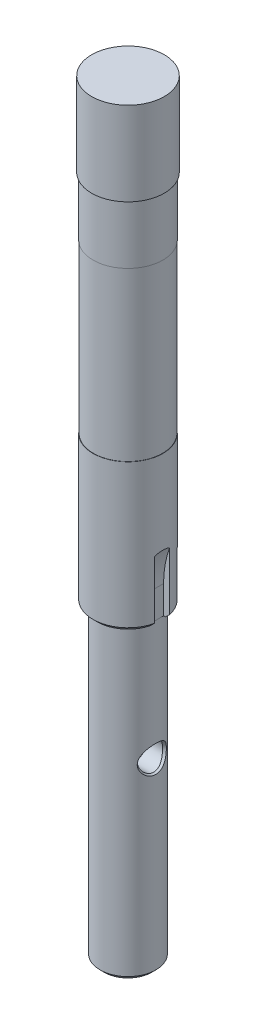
ISO-10303-21;
HEADER;
FILE_DESCRIPTION(('STEP AP214'),'2;1');
FILE_NAME('part.step','',(''),(''),'','','');
FILE_SCHEMA(('AUTOMOTIVE_DESIGN { 1 0 10303 214 1 1 1 1 }'));
ENDSEC;
DATA;
#1=APPLICATION_CONTEXT('core data for automotive mechanical design processes');
#2=APPLICATION_PROTOCOL_DEFINITION('international standard','automotive_design',2000,#1);
#3=PRODUCT_CONTEXT('',#1,'mechanical');
#4=PRODUCT('Part','Part','',(#3));
#5=PRODUCT_RELATED_PRODUCT_CATEGORY('part','',(#4));
#6=PRODUCT_DEFINITION_FORMATION('','',#4);
#7=PRODUCT_DEFINITION_CONTEXT('part definition',#1,'design');
#8=PRODUCT_DEFINITION('design','',#6,#7);
#9=PRODUCT_DEFINITION_SHAPE('','',#8);
#10=(LENGTH_UNIT() NAMED_UNIT(*) SI_UNIT(.MILLI.,.METRE.));
#11=(NAMED_UNIT(*) PLANE_ANGLE_UNIT() SI_UNIT($,.RADIAN.));
#12=(NAMED_UNIT(*) SI_UNIT($,.STERADIAN.) SOLID_ANGLE_UNIT());
#13=UNCERTAINTY_MEASURE_WITH_UNIT(LENGTH_MEASURE(1.E-05),#10,'distance_accuracy_value','');
#14=(GEOMETRIC_REPRESENTATION_CONTEXT(3) GLOBAL_UNCERTAINTY_ASSIGNED_CONTEXT((#13)) GLOBAL_UNIT_ASSIGNED_CONTEXT((#10,
#11,#12)) REPRESENTATION_CONTEXT('',''));
#15=CARTESIAN_POINT('',(0.,0.,0.));
#16=DIRECTION('',(0.,0.,1.));
#17=DIRECTION('',(1.,0.,0.));
#18=AXIS2_PLACEMENT_3D('',#15,#16,#17);
#19=CARTESIAN_POINT('',(0.,14.1587837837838,0.));
#20=DIRECTION('',(0.,1.,0.));
#21=DIRECTION('',(0.,0.,1.));
#22=AXIS2_PLACEMENT_3D('',#19,#20,#21);
#23=CYLINDRICAL_SURFACE('',#22,12.5);
#24=CARTESIAN_POINT('',(0.,-111.,0.));
#25=DIRECTION('',(0.,1.,0.));
#26=DIRECTION('',(0.,0.,1.));
#27=AXIS2_PLACEMENT_3D('',#24,#25,#26);
#28=CIRCLE('',#27,12.5);
#29=CARTESIAN_POINT('',(0.,-111.,12.5));
#30=VERTEX_POINT('',#29);
#31=EDGE_CURVE('E134',#30,#30,#28,.T.);
#32=ORIENTED_EDGE('',*,*,#31,.F.);
#33=EDGE_LOOP('',(#32));
#34=FACE_BOUND('',#33,.T.);
#35=CARTESIAN_POINT('',(12.1937483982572,-141.803694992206,2.75));
#36=CARTESIAN_POINT('',(12.2205381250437,-141.731634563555,2.63124158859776));
#37=CARTESIAN_POINT('',(12.2461131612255,-141.663569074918,2.50972630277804));
#38=CARTESIAN_POINT('',(12.2943703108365,-141.536195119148,2.26150738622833));
#39=CARTESIAN_POINT('',(12.3170498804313,-141.476894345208,2.13479932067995));
#40=CARTESIAN_POINT('',(12.3590829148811,-141.367740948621,1.87624425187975));
#41=CARTESIAN_POINT('',(12.3784235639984,-141.317924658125,1.74437973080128));
#42=CARTESIAN_POINT('',(12.4132049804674,-141.228818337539,1.47666887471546));
#43=CARTESIAN_POINT('',(12.428646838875,-141.189525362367,1.34082366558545));
#44=CARTESIAN_POINT('',(12.4553043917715,-141.121952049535,1.06520452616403));
#45=CARTESIAN_POINT('',(12.4664964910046,-141.093733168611,0.92541316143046));
#46=CARTESIAN_POINT('',(12.4842149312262,-141.049158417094,0.643662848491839));
#47=CARTESIAN_POINT('',(12.4907415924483,-141.032801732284,0.501704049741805));
#48=CARTESIAN_POINT('',(12.4989221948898,-141.012310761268,0.217117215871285));
#49=CARTESIAN_POINT('',(12.5005884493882,-141.008145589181,0.0744917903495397));
#50=CARTESIAN_POINT('',(12.4990414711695,-141.012018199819,-0.21052055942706));
#51=CARTESIAN_POINT('',(12.4958286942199,-141.02005484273,-0.352907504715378));
#52=CARTESIAN_POINT('',(12.4798084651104,-141.060211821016,-0.756978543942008));
#53=CARTESIAN_POINT('',(12.4611642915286,-141.107003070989,-1.01711693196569));
#54=CARTESIAN_POINT('',(12.40914479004,-141.23908181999,-1.52605566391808));
#55=CARTESIAN_POINT('',(12.375749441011,-141.324421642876,-1.77484008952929));
#56=CARTESIAN_POINT('',(12.315633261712,-141.480594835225,-2.14288587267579));
#57=CARTESIAN_POINT('',(12.2931391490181,-141.539430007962,-2.26812266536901));
#58=CARTESIAN_POINT('',(12.2454001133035,-141.665466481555,-2.51310011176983));
#59=CARTESIAN_POINT('',(12.2201670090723,-141.732632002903,-2.63286144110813));
#60=CARTESIAN_POINT('',(12.1937483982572,-141.803694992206,-2.74999999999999));
#61=B_SPLINE_CURVE_WITH_KNOTS('',3,(#35,#36,#37,#38,#39,#40,#41,#42,#43,#44,#45,#46,#47,#48,#49,
#50,#51,#52,#53,#54,#55,#56,#57,#58,#59,#60),.UNSPECIFIED.,.F.,.F.,(4,2,2,2,2,2,2,2,2,2,2,2,4),
(0.,0.424397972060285,0.849166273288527,1.27553036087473,1.70177500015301,2.13035275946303,
2.55890109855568,2.98636281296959,3.41378459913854,4.20477137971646,4.99683504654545,
5.41705501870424,5.83552885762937),.UNSPECIFIED.);
#62=CARTESIAN_POINT('',(12.1937483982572,-141.803694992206,2.75));
#63=VERTEX_POINT('',#62);
#64=CARTESIAN_POINT('',(12.1937483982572,-141.803694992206,-2.75));
#65=VERTEX_POINT('',#64);
#66=EDGE_CURVE('E12',#63,#65,#61,.T.);
#67=ORIENTED_EDGE('',*,*,#66,.T.);
#68=DIRECTION('',(0.,1.,0.));
#69=VECTOR('',#68,1.);
#70=CARTESIAN_POINT('',(12.1937483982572,14.1587837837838,-2.75));
#71=LINE('',#70,#69);
#72=CARTESIAN_POINT('',(12.1937483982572,-162.5,-2.75));
#73=VERTEX_POINT('',#72);
#74=EDGE_CURVE('E100',#65,#73,#71,.F.);
#75=ORIENTED_EDGE('',*,*,#74,.T.);
#76=CARTESIAN_POINT('',(0.,-162.5,0.));
#77=DIRECTION('',(0.,1.,0.));
#78=DIRECTION('',(0.,0.,1.));
#79=AXIS2_PLACEMENT_3D('',#76,#77,#78);
#80=CIRCLE('',#79,12.5);
#81=CARTESIAN_POINT('',(12.1937483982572,-162.5,2.75));
#82=VERTEX_POINT('',#81);
#83=EDGE_CURVE('E246',#73,#82,#80,.T.);
#84=ORIENTED_EDGE('',*,*,#83,.T.);
#85=DIRECTION('',(0.,1.,0.));
#86=VECTOR('',#85,1.);
#87=CARTESIAN_POINT('',(12.1937483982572,14.1587837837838,2.75));
#88=LINE('',#87,#86);
#89=EDGE_CURVE('E57',#63,#82,#88,.F.);
#90=ORIENTED_EDGE('',*,*,#89,.F.);
#91=EDGE_LOOP('',(#67,#75,#84,#90));
#92=FACE_BOUND('',#91,.T.);
#93=ADVANCED_FACE('F36',(#34,#92),#23,.T.);
#94=CARTESIAN_POINT('',(13.,0.,0.));
#95=DIRECTION('',(0.,-1.,0.));
#96=DIRECTION('',(0.,0.,-1.));
#97=AXIS2_PLACEMENT_3D('',#94,#95,#96);
#98=PLANE('',#97);
#99=CARTESIAN_POINT('',(0.,0.,0.));
#100=DIRECTION('',(0.,1.,0.));
#101=DIRECTION('',(0.,0.,1.));
#102=AXIS2_PLACEMENT_3D('',#99,#100,#101);
#103=CIRCLE('',#102,13.);
#104=CARTESIAN_POINT('',(0.,0.,13.));
#105=VERTEX_POINT('',#104);
#106=EDGE_CURVE('E152',#105,#105,#103,.T.);
#107=ORIENTED_EDGE('',*,*,#106,.T.);
#108=EDGE_LOOP('',(#107));
#109=FACE_BOUND('',#108,.T.);
#110=ADVANCED_FACE('F191',(#109),#98,.F.);
#111=CARTESIAN_POINT('',(0.,14.1587837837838,0.));
#112=DIRECTION('',(0.,1.,0.));
#113=DIRECTION('',(0.,0.,1.));
#114=AXIS2_PLACEMENT_3D('',#111,#112,#113);
#115=CYLINDRICAL_SURFACE('',#114,13.);
#116=ORIENTED_EDGE('',*,*,#106,.F.);
#117=EDGE_LOOP('',(#116));
#118=FACE_BOUND('',#117,.T.);
#119=CARTESIAN_POINT('',(0.,-30.,0.));
#120=DIRECTION('',(0.,1.,0.));
#121=DIRECTION('',(0.,0.,1.));
#122=AXIS2_PLACEMENT_3D('',#119,#120,#121);
#123=CIRCLE('',#122,13.);
#124=CARTESIAN_POINT('',(0.,-30.,13.));
#125=VERTEX_POINT('',#124);
#126=EDGE_CURVE('E149',#125,#125,#123,.T.);
#127=ORIENTED_EDGE('',*,*,#126,.T.);
#128=EDGE_LOOP('',(#127));
#129=FACE_BOUND('',#128,.T.);
#130=ADVANCED_FACE('F211',(#118,#129),#115,.T.);
#131=CARTESIAN_POINT('',(12.5,-30.,0.));
#132=DIRECTION('',(0.,1.,0.));
#133=DIRECTION('',(0.,0.,1.));
#134=AXIS2_PLACEMENT_3D('',#131,#132,#133);
#135=PLANE('',#134);
#136=ORIENTED_EDGE('',*,*,#126,.F.);
#137=EDGE_LOOP('',(#136));
#138=FACE_BOUND('',#137,.T.);
#139=CARTESIAN_POINT('',(0.,-30.,0.));
#140=DIRECTION('',(0.,1.,0.));
#141=DIRECTION('',(0.,0.,1.));
#142=AXIS2_PLACEMENT_3D('',#139,#140,#141);
#143=CIRCLE('',#142,12.5);
#144=CARTESIAN_POINT('',(0.,-30.,12.5));
#145=VERTEX_POINT('',#144);
#146=EDGE_CURVE('E146',#145,#145,#143,.T.);
#147=ORIENTED_EDGE('',*,*,#146,.T.);
#148=EDGE_LOOP('',(#147));
#149=FACE_BOUND('',#148,.T.);
#150=ADVANCED_FACE('F207',(#138,#149),#135,.F.);
#151=CARTESIAN_POINT('',(0.,14.1587837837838,0.));
#152=DIRECTION('',(0.,1.,0.));
#153=DIRECTION('',(0.,0.,1.));
#154=AXIS2_PLACEMENT_3D('',#151,#152,#153);
#155=CYLINDRICAL_SURFACE('',#154,12.5);
#156=ORIENTED_EDGE('',*,*,#146,.F.);
#157=EDGE_LOOP('',(#156));
#158=FACE_BOUND('',#157,.T.);
#159=CARTESIAN_POINT('',(0.,-51.,0.));
#160=DIRECTION('',(0.,1.,0.));
#161=DIRECTION('',(0.,0.,1.));
#162=AXIS2_PLACEMENT_3D('',#159,#160,#161);
#163=CIRCLE('',#162,12.5);
#164=CARTESIAN_POINT('',(0.,-51.,12.5));
#165=VERTEX_POINT('',#164);
#166=EDGE_CURVE('E143',#165,#165,#163,.T.);
#167=ORIENTED_EDGE('',*,*,#166,.T.);
#168=EDGE_LOOP('',(#167));
#169=FACE_BOUND('',#168,.T.);
#170=ADVANCED_FACE('F203',(#158,#169),#155,.T.);
#171=CARTESIAN_POINT('',(12.4,-51.,0.));
#172=DIRECTION('',(0.,1.,0.));
#173=DIRECTION('',(0.,0.,1.));
#174=AXIS2_PLACEMENT_3D('',#171,#172,#173);
#175=PLANE('',#174);
#176=ORIENTED_EDGE('',*,*,#166,.F.);
#177=EDGE_LOOP('',(#176));
#178=FACE_BOUND('',#177,.T.);
#179=CARTESIAN_POINT('',(0.,-51.,0.));
#180=DIRECTION('',(0.,1.,0.));
#181=DIRECTION('',(0.,0.,1.));
#182=AXIS2_PLACEMENT_3D('',#179,#180,#181);
#183=CIRCLE('',#182,12.4);
#184=CARTESIAN_POINT('',(0.,-51.,12.4));
#185=VERTEX_POINT('',#184);
#186=EDGE_CURVE('E140',#185,#185,#183,.T.);
#187=ORIENTED_EDGE('',*,*,#186,.T.);
#188=EDGE_LOOP('',(#187));
#189=FACE_BOUND('',#188,.T.);
#190=ADVANCED_FACE('F199',(#178,#189),#175,.F.);
#191=CARTESIAN_POINT('',(0.,14.1587837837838,0.));
#192=DIRECTION('',(0.,1.,0.));
#193=DIRECTION('',(0.,0.,1.));
#194=AXIS2_PLACEMENT_3D('',#191,#192,#193);
#195=CYLINDRICAL_SURFACE('',#194,12.4);
#196=ORIENTED_EDGE('',*,*,#186,.F.);
#197=EDGE_LOOP('',(#196));
#198=FACE_BOUND('',#197,.T.);
#199=CARTESIAN_POINT('',(0.,-111.,0.));
#200=DIRECTION('',(0.,1.,0.));
#201=DIRECTION('',(0.,0.,1.));
#202=AXIS2_PLACEMENT_3D('',#199,#200,#201);
#203=CIRCLE('',#202,12.4);
#204=CARTESIAN_POINT('',(0.,-111.,12.4));
#205=VERTEX_POINT('',#204);
#206=EDGE_CURVE('E137',#205,#205,#203,.T.);
#207=ORIENTED_EDGE('',*,*,#206,.T.);
#208=EDGE_LOOP('',(#207));
#209=FACE_BOUND('',#208,.T.);
#210=ADVANCED_FACE('F195',(#198,#209),#195,.T.);
#211=CARTESIAN_POINT('',(12.5,-111.,0.));
#212=DIRECTION('',(0.,-1.,0.));
#213=DIRECTION('',(0.,0.,-1.));
#214=AXIS2_PLACEMENT_3D('',#211,#212,#213);
#215=PLANE('',#214);
#216=ORIENTED_EDGE('',*,*,#206,.F.);
#217=EDGE_LOOP('',(#216));
#218=FACE_BOUND('',#217,.T.);
#219=ORIENTED_EDGE('',*,*,#31,.T.);
#220=EDGE_LOOP('',(#219));
#221=FACE_BOUND('',#220,.T.);
#222=ADVANCED_FACE('F186',(#218,#221),#215,.F.);
#223=CARTESIAN_POINT('',(10.,-164.,0.));
#224=DIRECTION('',(0.,1.,0.));
#225=DIRECTION('',(0.,0.,1.));
#226=AXIS2_PLACEMENT_3D('',#223,#224,#225);
#227=PLANE('',#226);
#228=CARTESIAN_POINT('',(0.,-164.,0.));
#229=DIRECTION('',(0.,1.,0.));
#230=DIRECTION('',(0.,0.,1.));
#231=AXIS2_PLACEMENT_3D('',#228,#229,#230);
#232=CIRCLE('',#231,11.);
#233=CARTESIAN_POINT('',(10.6507042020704,-164.,2.75));
#234=VERTEX_POINT('',#233);
#235=CARTESIAN_POINT('',(10.6507042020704,-164.,-2.75));
#236=VERTEX_POINT('',#235);
#237=EDGE_CURVE('E254',#234,#236,#232,.F.);
#238=ORIENTED_EDGE('',*,*,#237,.T.);
#239=DIRECTION('',(1.,0.,0.));
#240=VECTOR('',#239,1.);
#241=CARTESIAN_POINT('',(12.5,-164.,-2.75));
#242=LINE('',#241,#240);
#243=CARTESIAN_POINT('',(10.,-164.,-2.75));
#244=VERTEX_POINT('',#243);
#245=EDGE_CURVE('E102',#244,#236,#242,.T.);
#246=ORIENTED_EDGE('',*,*,#245,.F.);
#247=DIRECTION('',(0.,0.,1.));
#248=VECTOR('',#247,1.);
#249=CARTESIAN_POINT('',(10.,-164.,-2.75));
#250=LINE('',#249,#248);
#251=CARTESIAN_POINT('',(10.,-164.,0.));
#252=VERTEX_POINT('',#251);
#253=EDGE_CURVE('E115',#244,#252,#250,.T.);
#254=ORIENTED_EDGE('',*,*,#253,.T.);
#255=CARTESIAN_POINT('',(0.,-164.,0.));
#256=DIRECTION('',(0.,1.,0.));
#257=DIRECTION('',(0.,0.,1.));
#258=AXIS2_PLACEMENT_3D('',#255,#256,#257);
#259=CIRCLE('',#258,10.);
#260=EDGE_CURVE('E131',#252,#252,#259,.T.);
#261=ORIENTED_EDGE('',*,*,#260,.T.);
#262=CARTESIAN_POINT('',(10.,-164.,2.75));
#263=VERTEX_POINT('',#262);
#264=EDGE_CURVE('E111',#252,#263,#250,.T.);
#265=ORIENTED_EDGE('',*,*,#264,.T.);
#266=DIRECTION('',(1.,0.,0.));
#267=VECTOR('',#266,1.);
#268=CARTESIAN_POINT('',(12.5,-164.,2.75));
#269=LINE('',#268,#267);
#270=EDGE_CURVE('E119',#263,#234,#269,.T.);
#271=ORIENTED_EDGE('',*,*,#270,.T.);
#272=EDGE_LOOP('',(#238,#246,#254,#261,#265,#271));
#273=FACE_BOUND('',#272,.T.);
#274=ADVANCED_FACE('F183',(#273),#227,.F.);
#275=CARTESIAN_POINT('',(0.,14.1587837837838,0.));
#276=DIRECTION('',(0.,1.,0.));
#277=DIRECTION('',(0.,0.,1.));
#278=AXIS2_PLACEMENT_3D('',#275,#276,#277);
#279=CYLINDRICAL_SURFACE('',#278,10.);
#280=CARTESIAN_POINT('',(8.53041436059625,-207.,-5.21843183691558));
#281=CARTESIAN_POINT('',(8.53043923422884,-206.959501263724,-5.21838043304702));
#282=CARTESIAN_POINT('',(8.53083475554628,-206.919004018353,-5.2177644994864));
#283=CARTESIAN_POINT('',(8.53234603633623,-206.838147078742,-5.21541331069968));
#284=CARTESIAN_POINT('',(8.53346016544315,-206.797787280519,-5.21368058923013));
#285=CARTESIAN_POINT('',(8.53638544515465,-206.717223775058,-5.20910908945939));
#286=CARTESIAN_POINT('',(8.5381954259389,-206.677019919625,-5.20627216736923));
#287=CARTESIAN_POINT('',(8.54248871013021,-206.596786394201,-5.19950622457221));
#288=CARTESIAN_POINT('',(8.54497124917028,-206.556756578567,-5.19557844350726));
#289=CARTESIAN_POINT('',(8.55058615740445,-206.476889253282,-5.18664446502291));
#290=CARTESIAN_POINT('',(8.55371811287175,-206.437051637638,-5.18163895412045));
#291=CARTESIAN_POINT('',(8.56060835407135,-206.357586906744,-5.17056322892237));
#292=CARTESIAN_POINT('',(8.56436652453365,-206.317959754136,-5.16449321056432));
#293=CARTESIAN_POINT('',(8.5724858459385,-206.23893360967,-5.15130195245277));
#294=CARTESIAN_POINT('',(8.57684713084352,-206.199534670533,-5.14418047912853));
#295=CARTESIAN_POINT('',(8.58614904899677,-206.120984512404,-5.12890030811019));
#296=CARTESIAN_POINT('',(8.59109001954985,-206.081833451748,-5.12074100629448));
#297=CARTESIAN_POINT('',(8.60675583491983,-205.96471492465,-5.09471263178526));
#298=CARTESIAN_POINT('',(8.61831215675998,-205.887192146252,-5.07531151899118));
#299=CARTESIAN_POINT('',(8.6434603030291,-205.733356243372,-5.03252591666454));
#300=CARTESIAN_POINT('',(8.65705779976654,-205.657047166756,-5.00913030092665));
#301=CARTESIAN_POINT('',(8.68610268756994,-205.505774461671,-4.9584627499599));
#302=CARTESIAN_POINT('',(8.70155650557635,-205.430816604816,-4.93117728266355));
#303=CARTESIAN_POINT('',(8.73412831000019,-205.282391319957,-4.87283734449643));
#304=CARTESIAN_POINT('',(8.75125276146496,-205.208931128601,-4.84176810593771));
#305=CARTESIAN_POINT('',(8.78698101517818,-205.063644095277,-4.77596638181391));
#306=CARTESIAN_POINT('',(8.80559082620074,-204.991825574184,-4.74121881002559));
#307=CARTESIAN_POINT('',(8.84410538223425,-204.849965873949,-4.66816543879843));
#308=CARTESIAN_POINT('',(8.8640153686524,-204.779933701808,-4.62984493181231));
#309=CARTESIAN_POINT('',(8.90494599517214,-204.641790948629,-4.54974996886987));
#310=CARTESIAN_POINT('',(8.92597094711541,-204.57368966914,-4.50796168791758));
#311=CARTESIAN_POINT('',(8.96894787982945,-204.439553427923,-4.42103519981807));
#312=CARTESIAN_POINT('',(8.99090319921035,-204.373527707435,-4.37588439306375));
#313=CARTESIAN_POINT('',(9.03555523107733,-204.243687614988,-4.28233578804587));
#314=CARTESIAN_POINT('',(9.05825434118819,-204.179882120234,-4.23392681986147));
#315=CARTESIAN_POINT('',(9.10421586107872,-204.054628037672,-4.1339675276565));
#316=CARTESIAN_POINT('',(9.12747985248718,-203.993187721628,-4.08240756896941));
#317=CARTESIAN_POINT('',(9.17436440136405,-203.8728090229,-3.97624100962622));
#318=CARTESIAN_POINT('',(9.19798577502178,-203.813878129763,-3.92162628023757));
#319=CARTESIAN_POINT('',(9.24548512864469,-203.69866641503,-3.80948551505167));
#320=CARTESIAN_POINT('',(9.26936358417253,-203.642392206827,-3.75195288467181));
#321=CARTESIAN_POINT('',(9.31691145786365,-203.532550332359,-3.63387272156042));
#322=CARTESIAN_POINT('',(9.34057987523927,-203.478992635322,-3.57331550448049));
#323=CARTESIAN_POINT('',(9.38729489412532,-203.374590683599,-3.44916549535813));
#324=CARTESIAN_POINT('',(9.4103381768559,-203.323759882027,-3.38556014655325));
#325=CARTESIAN_POINT('',(9.45575441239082,-203.224915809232,-3.25551984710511));
#326=CARTESIAN_POINT('',(9.47812420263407,-203.176915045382,-3.18907429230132));
#327=CARTESIAN_POINT('',(9.52203685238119,-203.083833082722,-3.05351930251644));
#328=CARTESIAN_POINT('',(9.54357637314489,-203.038763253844,-2.98440098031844));
#329=CARTESIAN_POINT('',(9.58570085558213,-202.951646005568,-2.84367710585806));
#330=CARTESIAN_POINT('',(9.60628254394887,-202.909608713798,-2.77206430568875));
#331=CARTESIAN_POINT('',(9.64635575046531,-202.828659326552,-2.62652532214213));
#332=CARTESIAN_POINT('',(9.6658441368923,-202.7897560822,-2.55259335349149));
#333=CARTESIAN_POINT('',(9.70359713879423,-202.715177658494,-2.4025908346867));
#334=CARTESIAN_POINT('',(9.72185884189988,-202.679510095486,-2.32651576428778));
#335=CARTESIAN_POINT('',(9.75702423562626,-202.611505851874,-2.17240182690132));
#336=CARTESIAN_POINT('',(9.7739252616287,-202.579175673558,-2.09435948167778));
#337=CARTESIAN_POINT('',(9.80623518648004,-202.51794889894,-1.93648605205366));
#338=CARTESIAN_POINT('',(9.82164164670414,-202.489057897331,-1.85665229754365));
#339=CARTESIAN_POINT('',(9.85082830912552,-202.434811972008,-1.6953713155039));
#340=CARTESIAN_POINT('',(9.86460621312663,-202.409462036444,-1.61392199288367));
#341=CARTESIAN_POINT('',(9.89040174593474,-202.362400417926,-1.44958536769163));
#342=CARTESIAN_POINT('',(9.90241705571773,-202.340693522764,-1.3666963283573));
#343=CARTESIAN_POINT('',(9.92455351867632,-202.30101981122,-1.19965596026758));
#344=CARTESIAN_POINT('',(9.934672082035,-202.283058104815,-1.11550307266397));
#345=CARTESIAN_POINT('',(9.95288156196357,-202.250975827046,-0.946110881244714));
#346=CARTESIAN_POINT('',(9.96096926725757,-202.236861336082,-0.860870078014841));
#347=CARTESIAN_POINT('',(9.97498343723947,-202.212574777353,-0.689477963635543));
#348=CARTESIAN_POINT('',(9.98090560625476,-202.202410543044,-0.603325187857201));
#349=CARTESIAN_POINT('',(9.99045735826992,-202.186121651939,-0.430285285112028));
#350=CARTESIAN_POINT('',(9.99408098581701,-202.180007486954,-0.343396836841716));
#351=CARTESIAN_POINT('',(9.99889829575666,-202.171927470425,-0.169060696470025));
#352=CARTESIAN_POINT('',(10.0000836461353,-202.169975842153,-0.0816121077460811));
#353=CARTESIAN_POINT('',(9.99991297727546,-202.170280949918,0.0932501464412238));
#354=CARTESIAN_POINT('',(9.99855766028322,-202.172536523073,0.180663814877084));
#355=CARTESIAN_POINT('',(9.99343669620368,-202.181156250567,0.354869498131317));
#356=CARTESIAN_POINT('',(9.98968057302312,-202.18750417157,0.441662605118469));
#357=CARTESIAN_POINT('',(9.97988732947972,-202.204217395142,0.614459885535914));
#358=CARTESIAN_POINT('',(9.97385726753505,-202.214570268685,0.700465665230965));
#359=CARTESIAN_POINT('',(9.95965132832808,-202.23919074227,0.87152100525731));
#360=CARTESIAN_POINT('',(9.95148067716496,-202.253448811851,0.956572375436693));
#361=CARTESIAN_POINT('',(9.93312634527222,-202.285781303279,1.1255519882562));
#362=CARTESIAN_POINT('',(9.92294661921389,-202.30384823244,1.20948209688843));
#363=CARTESIAN_POINT('',(9.9007068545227,-202.343700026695,1.376052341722));
#364=CARTESIAN_POINT('',(9.8886499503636,-202.365478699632,1.45869438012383));
#365=CARTESIAN_POINT('',(9.86278799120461,-202.412656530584,1.62252162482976));
#366=CARTESIAN_POINT('',(9.84898560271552,-202.438050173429,1.70370884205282));
#367=CARTESIAN_POINT('',(9.81976453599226,-202.492361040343,1.86445947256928));
#368=CARTESIAN_POINT('',(9.80434831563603,-202.521272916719,1.94402514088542));
#369=CARTESIAN_POINT('',(9.77203120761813,-202.582523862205,2.10136554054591));
#370=CARTESIAN_POINT('',(9.75513274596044,-202.614857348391,2.17914294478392));
#371=CARTESIAN_POINT('',(9.71998258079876,-202.682855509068,2.33273947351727));
#372=CARTESIAN_POINT('',(9.70173337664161,-202.718514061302,2.4085618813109));
#373=CARTESIAN_POINT('',(9.66401320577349,-202.793066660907,2.55808090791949));
#374=CARTESIAN_POINT('',(9.64454485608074,-202.831953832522,2.63178161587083));
#375=CARTESIAN_POINT('',(9.60451729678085,-202.91286813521,2.77688935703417));
#376=CARTESIAN_POINT('',(9.58396081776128,-202.954887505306,2.84830147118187));
#377=CARTESIAN_POINT('',(9.54188993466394,-203.041970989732,2.98866456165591));
#378=CARTESIAN_POINT('',(9.52037832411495,-203.087026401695,3.05762177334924));
#379=CARTESIAN_POINT('',(9.47652265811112,-203.180086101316,3.19290512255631));
#380=CARTESIAN_POINT('',(9.45418140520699,-203.228080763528,3.25923878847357));
#381=CARTESIAN_POINT('',(9.40881989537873,-203.32692571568,3.38911352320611));
#382=CARTESIAN_POINT('',(9.38580225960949,-203.377765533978,3.45266347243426));
#383=CARTESIAN_POINT('',(9.3391379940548,-203.482197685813,3.57677741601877));
#384=CARTESIAN_POINT('',(9.31549407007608,-203.535778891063,3.6373517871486));
#385=CARTESIAN_POINT('',(9.26798571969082,-203.645686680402,3.75550331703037));
#386=CARTESIAN_POINT('',(9.24412214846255,-203.702004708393,3.81308878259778));
#387=CARTESIAN_POINT('',(9.19663863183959,-203.817327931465,3.92532258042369));
#388=CARTESIAN_POINT('',(9.17301826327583,-203.876326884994,3.97997714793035));
#389=CARTESIAN_POINT('',(9.1261285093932,-203.996859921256,4.08621592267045));
#390=CARTESIAN_POINT('',(9.10285835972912,-204.058386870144,4.13780788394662));
#391=CARTESIAN_POINT('',(9.0568790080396,-204.183833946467,4.23781995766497));
#392=CARTESIAN_POINT('',(9.03416830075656,-204.2477461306,4.28624933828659));
#393=CARTESIAN_POINT('',(8.98949059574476,-204.377818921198,4.37982617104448));
#394=CARTESIAN_POINT('',(8.96752129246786,-204.443970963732,4.42498441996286));
#395=CARTESIAN_POINT('',(8.92451659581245,-204.578379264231,4.51191119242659));
#396=CARTESIAN_POINT('',(8.90347797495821,-204.646626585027,4.55369192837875));
#397=CARTESIAN_POINT('',(8.86252298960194,-204.785080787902,4.63375537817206));
#398=CARTESIAN_POINT('',(8.84260244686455,-204.855278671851,4.67205150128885));
#399=CARTESIAN_POINT('',(8.80407250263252,-204.997489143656,4.74503782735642));
#400=CARTESIAN_POINT('',(8.78545802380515,-205.069493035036,4.77974227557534));
#401=CARTESIAN_POINT('',(8.74972890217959,-205.215170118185,4.84543765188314));
#402=CARTESIAN_POINT('',(8.73260845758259,-205.288835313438,4.87644313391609));
#403=CARTESIAN_POINT('',(8.70005586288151,-205.437689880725,4.93463365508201));
#404=CARTESIAN_POINT('',(8.68461751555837,-205.512872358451,4.96183283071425));
#405=CARTESIAN_POINT('',(8.65561747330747,-205.66461351,5.01230412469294));
#406=CARTESIAN_POINT('',(8.64204970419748,-205.7411667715,5.0355890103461));
#407=CARTESIAN_POINT('',(8.61697760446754,-205.895510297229,5.07812773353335));
#408=CARTESIAN_POINT('',(8.60546806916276,-205.973296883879,5.09739175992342));
#409=CARTESIAN_POINT('',(8.58988806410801,-206.090816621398,5.12319215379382));
#410=CARTESIAN_POINT('',(8.5849778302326,-206.130106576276,5.13127251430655));
#411=CARTESIAN_POINT('',(8.57574258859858,-206.208939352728,5.1463876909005));
#412=CARTESIAN_POINT('',(8.5714173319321,-206.248482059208,5.15342295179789));
#413=CARTESIAN_POINT('',(8.56337560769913,-206.327800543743,5.1664344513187));
#414=CARTESIAN_POINT('',(8.55965910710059,-206.367576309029,5.17241074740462));
#415=CARTESIAN_POINT('',(8.55285808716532,-206.447343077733,5.18329146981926));
#416=CARTESIAN_POINT('',(8.54977379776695,-206.487334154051,5.18819550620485));
#417=CARTESIAN_POINT('',(8.54426040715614,-206.567513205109,5.19691879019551));
#418=CARTESIAN_POINT('',(8.54183184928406,-206.60770131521,5.20073713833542));
#419=CARTESIAN_POINT('',(8.53765315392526,-206.688256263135,5.20727614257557));
#420=CARTESIAN_POINT('',(8.53590392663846,-206.728623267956,5.20999532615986));
#421=CARTESIAN_POINT('',(8.53310670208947,-206.809517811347,5.21432347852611));
#422=CARTESIAN_POINT('',(8.53206003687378,-206.850045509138,5.21593033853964));
#423=CARTESIAN_POINT('',(8.5306920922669,-206.931243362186,5.21802015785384));
#424=CARTESIAN_POINT('',(8.53037262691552,-206.971913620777,5.21850030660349));
#425=CARTESIAN_POINT('',(8.53047774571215,-207.053240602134,5.2183279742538));
#426=CARTESIAN_POINT('',(8.53090214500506,-207.093897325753,5.21767577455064));
#427=CARTESIAN_POINT('',(8.53247182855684,-207.175042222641,5.2152491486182));
#428=CARTESIAN_POINT('',(8.53361496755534,-207.215530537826,5.21347806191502));
#429=CARTESIAN_POINT('',(8.53659941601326,-207.296321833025,5.20882680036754));
#430=CARTESIAN_POINT('',(8.53843907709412,-207.336625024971,5.20594924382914));
#431=CARTESIAN_POINT('',(8.54279250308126,-207.417029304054,5.19909935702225));
#432=CARTESIAN_POINT('',(8.54530506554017,-207.457130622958,5.19512897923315));
#433=CARTESIAN_POINT('',(8.55098066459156,-207.537114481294,5.18610736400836));
#434=CARTESIAN_POINT('',(8.55414288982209,-207.576997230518,5.18105747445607));
#435=CARTESIAN_POINT('',(8.56109411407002,-207.656527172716,5.16989081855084));
#436=CARTESIAN_POINT('',(8.56488264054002,-207.696174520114,5.16377485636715));
#437=CARTESIAN_POINT('',(8.5730629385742,-207.775217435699,5.15048979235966));
#438=CARTESIAN_POINT('',(8.57745452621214,-207.814613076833,5.14332101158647));
#439=CARTESIAN_POINT('',(8.58681711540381,-207.893134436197,5.12794459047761));
#440=CARTESIAN_POINT('',(8.59178817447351,-207.932260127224,5.11973684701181));
#441=CARTESIAN_POINT('',(8.60754090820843,-208.049247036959,5.09356636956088));
#442=CARTESIAN_POINT('',(8.61915598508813,-208.126659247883,5.07406631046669));
#443=CARTESIAN_POINT('',(8.64442070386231,-208.280201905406,5.0310775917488));
#444=CARTESIAN_POINT('',(8.65807458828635,-208.356329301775,5.00758060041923));
#445=CARTESIAN_POINT('',(8.68722964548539,-208.507178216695,4.9567075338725));
#446=CARTESIAN_POINT('',(8.70273625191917,-208.581894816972,4.92932000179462));
#447=CARTESIAN_POINT('',(8.73540945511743,-208.729788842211,4.87077553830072));
#448=CARTESIAN_POINT('',(8.75258187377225,-208.802959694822,4.83960528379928));
#449=CARTESIAN_POINT('',(8.78840039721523,-208.947631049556,4.77360340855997));
#450=CARTESIAN_POINT('',(8.80705213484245,-209.019123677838,4.73875760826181));
#451=CARTESIAN_POINT('',(8.84564347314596,-209.160306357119,4.66551184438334));
#452=CARTESIAN_POINT('',(8.86558813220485,-209.229987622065,4.62709763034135));
#453=CARTESIAN_POINT('',(8.906579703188,-209.367415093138,4.54682141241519));
#454=CARTESIAN_POINT('',(8.92763087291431,-209.43515199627,4.50494567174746));
#455=CARTESIAN_POINT('',(8.97065055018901,-209.568557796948,4.41785244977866));
#456=CARTESIAN_POINT('',(8.99262241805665,-209.634217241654,4.37262215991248));
#457=CARTESIAN_POINT('',(9.03729669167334,-209.76333479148,4.27892469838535));
#458=CARTESIAN_POINT('',(9.06000154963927,-209.826783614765,4.23044591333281));
#459=CARTESIAN_POINT('',(9.10596229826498,-209.951346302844,4.13035909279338));
#460=CARTESIAN_POINT('',(9.12921982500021,-210.012451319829,4.07874080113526));
#461=CARTESIAN_POINT('',(9.1760788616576,-210.132192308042,3.97247113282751));
#462=CARTESIAN_POINT('',(9.19968121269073,-210.190820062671,3.91781087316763));
#463=CARTESIAN_POINT('',(9.24712569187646,-210.305472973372,3.80559587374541));
#464=CARTESIAN_POINT('',(9.27096829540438,-210.36149067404,3.74803371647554));
#465=CARTESIAN_POINT('',(9.31843703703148,-210.470865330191,3.62990977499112));
#466=CARTESIAN_POINT('',(9.34206202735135,-210.524211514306,3.56933754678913));
#467=CARTESIAN_POINT('',(9.38869386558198,-210.62822090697,3.44516724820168));
#468=CARTESIAN_POINT('',(9.41169720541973,-210.678870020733,3.38155605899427));
#469=CARTESIAN_POINT('',(9.45703418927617,-210.777381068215,3.25151440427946));
#470=CARTESIAN_POINT('',(9.4793645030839,-210.82522998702,3.18507292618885));
#471=CARTESIAN_POINT('',(9.5231996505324,-210.918034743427,3.04953520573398));
#472=CARTESIAN_POINT('',(9.54470099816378,-210.962978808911,2.9804297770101));
#473=CARTESIAN_POINT('',(9.58675036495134,-211.049868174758,2.83974011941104));
#474=CARTESIAN_POINT('',(9.60729498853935,-211.091803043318,2.76814843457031));
#475=CARTESIAN_POINT('',(9.64729534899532,-211.172568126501,2.62265931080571));
#476=CARTESIAN_POINT('',(9.66674785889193,-211.21138927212,2.54875595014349));
#477=CARTESIAN_POINT('',(9.70443036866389,-211.285821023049,2.39881752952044));
#478=CARTESIAN_POINT('',(9.72265738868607,-211.321423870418,2.32277786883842));
#479=CARTESIAN_POINT('',(9.7577546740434,-211.389313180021,2.16874089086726));
#480=CARTESIAN_POINT('',(9.77462223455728,-211.421593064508,2.09074005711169));
#481=CARTESIAN_POINT('',(9.80686647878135,-211.482730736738,1.9329550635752));
#482=CARTESIAN_POINT('',(9.82224070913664,-211.511582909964,1.85316822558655));
#483=CARTESIAN_POINT('',(9.85136415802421,-211.565759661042,1.69198577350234));
#484=CARTESIAN_POINT('',(9.86511108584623,-211.591079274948,1.61058807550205));
#485=CARTESIAN_POINT('',(9.89084591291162,-211.638085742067,1.44635869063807));
#486=CARTESIAN_POINT('',(9.90283151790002,-211.659767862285,1.36352528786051));
#487=CARTESIAN_POINT('',(9.92490981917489,-211.699394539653,1.1965994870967));
#488=CARTESIAN_POINT('',(9.93499996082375,-211.717334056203,1.11250555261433));
#489=CARTESIAN_POINT('',(9.95315387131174,-211.749371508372,0.943233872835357));
#490=CARTESIAN_POINT('',(9.96121446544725,-211.763463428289,0.85805464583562));
#491=CARTESIAN_POINT('',(9.97517565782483,-211.787701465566,0.686787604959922));
#492=CARTESIAN_POINT('',(9.98107198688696,-211.797839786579,0.600698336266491));
#493=CARTESIAN_POINT('',(9.99057352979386,-211.814070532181,0.427786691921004));
#494=CARTESIAN_POINT('',(9.99417279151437,-211.820152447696,0.340962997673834));
#495=CARTESIAN_POINT('',(9.99894216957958,-211.828158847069,0.166756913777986));
#496=CARTESIAN_POINT('',(10.0001039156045,-211.830069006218,0.0793736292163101));
#497=CARTESIAN_POINT('',(9.99988970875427,-211.829668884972,-0.0953556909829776));
#498=CARTESIAN_POINT('',(9.99851443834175,-211.827359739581,-0.182701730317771));
#499=CARTESIAN_POINT('',(9.99335974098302,-211.818624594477,-0.356768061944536));
#500=CARTESIAN_POINT('',(9.98958983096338,-211.812214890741,-0.443489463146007));
#501=CARTESIAN_POINT('',(9.97977423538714,-211.795374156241,-0.616139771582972));
#502=CARTESIAN_POINT('',(9.97373558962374,-211.784955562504,-0.702070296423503));
#503=CARTESIAN_POINT('',(9.9595176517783,-211.760203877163,-0.872972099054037));
#504=CARTESIAN_POINT('',(9.95134356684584,-211.745880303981,-0.957945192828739));
#505=CARTESIAN_POINT('',(9.93298722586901,-211.713421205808,-1.12676575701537));
#506=CARTESIAN_POINT('',(9.92280891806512,-211.69529317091,-1.21061509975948));
#507=CARTESIAN_POINT('',(9.90057659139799,-211.655327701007,-1.37702184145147));
#508=CARTESIAN_POINT('',(9.88852572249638,-211.633496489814,-1.45958115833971));
#509=CARTESIAN_POINT('',(9.86268015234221,-211.586226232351,-1.62324150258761));
#510=CARTESIAN_POINT('',(9.84888816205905,-211.560792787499,-1.70434457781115));
#511=CARTESIAN_POINT('',(9.81969192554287,-211.506419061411,-1.86492596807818));
#512=CARTESIAN_POINT('',(9.8042902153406,-211.477484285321,-1.94440660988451));
#513=CARTESIAN_POINT('',(9.7720058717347,-211.41620836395,-2.10157648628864));
#514=CARTESIAN_POINT('',(9.75512577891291,-211.383873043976,-2.17926851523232));
#515=CARTESIAN_POINT('',(9.72001580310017,-211.315896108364,-2.33269429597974));
#516=CARTESIAN_POINT('',(9.70178857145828,-211.280260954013,-2.40843151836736));
#517=CARTESIAN_POINT('',(9.66411550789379,-211.205784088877,-2.55778062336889));
#518=CARTESIAN_POINT('',(9.64467248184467,-211.166949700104,-2.6313968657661));
#519=CARTESIAN_POINT('',(9.60469843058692,-211.086173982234,-2.77633658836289));
#520=CARTESIAN_POINT('',(9.58417035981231,-211.044240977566,-2.84766552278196));
#521=CARTESIAN_POINT('',(9.5421589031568,-210.957367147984,-2.98786347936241));
#522=CARTESIAN_POINT('',(9.5206785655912,-210.912435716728,-3.05673923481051));
#523=CARTESIAN_POINT('',(9.47688763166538,-210.819665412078,-3.19186167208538));
#524=CARTESIAN_POINT('',(9.45458012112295,-210.77183699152,-3.25811652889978));
#525=CARTESIAN_POINT('',(9.40928850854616,-210.673368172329,-3.38783459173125));
#526=CARTESIAN_POINT('',(9.38630732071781,-210.622739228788,-3.45130750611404));
#527=CARTESIAN_POINT('',(9.33971625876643,-210.518783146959,-3.57527395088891));
#528=CARTESIAN_POINT('',(9.31610943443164,-210.465468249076,-3.63577888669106));
#529=CARTESIAN_POINT('',(9.2686719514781,-210.356103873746,-3.75380360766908));
#530=CARTESIAN_POINT('',(9.24484218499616,-210.300063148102,-3.81133186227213));
#531=CARTESIAN_POINT('',(9.1974201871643,-210.185265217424,-3.92346798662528));
#532=CARTESIAN_POINT('',(9.17382758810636,-210.126513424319,-3.97808124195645));
#533=CARTESIAN_POINT('',(9.12698563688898,-210.006455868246,-4.08425787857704));
#534=CARTESIAN_POINT('',(9.10373559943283,-209.945156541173,-4.13582823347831));
#535=CARTESIAN_POINT('',(9.05778941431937,-209.820148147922,-4.23581442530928));
#536=CARTESIAN_POINT('',(9.03509187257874,-209.756446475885,-4.28423886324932));
#537=CARTESIAN_POINT('',(8.99043350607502,-209.62678261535,-4.37782179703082));
#538=CARTESIAN_POINT('',(8.96847049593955,-209.560828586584,-4.42299055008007));
#539=CARTESIAN_POINT('',(8.92547164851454,-209.42680809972,-4.50995246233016));
#540=CARTESIAN_POINT('',(8.90443269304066,-209.358750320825,-4.55175744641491));
#541=CARTESIAN_POINT('',(8.86347053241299,-209.220671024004,-4.63188177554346));
#542=CARTESIAN_POINT('',(8.84354322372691,-209.15065838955,-4.67021431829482));
#543=CARTESIAN_POINT('',(8.80499350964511,-209.008818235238,-4.74328405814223));
#544=CARTESIAN_POINT('',(8.78636604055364,-208.936999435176,-4.77803549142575));
#545=CARTESIAN_POINT('',(8.75060499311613,-208.791696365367,-4.84383358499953));
#546=CARTESIAN_POINT('',(8.73346553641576,-208.718220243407,-4.87489502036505));
#547=CARTESIAN_POINT('',(8.70086929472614,-208.569751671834,-4.93320433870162));
#548=CARTESIAN_POINT('',(8.6854061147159,-208.494766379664,-4.96046683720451));
#549=CARTESIAN_POINT('',(8.65635114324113,-208.343431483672,-5.01106977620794));
#550=CARTESIAN_POINT('',(8.64275292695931,-208.267087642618,-5.03442374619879));
#551=CARTESIAN_POINT('',(8.61761504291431,-208.113178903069,-5.07710374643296));
#552=CARTESIAN_POINT('',(8.60606963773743,-208.035618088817,-5.09644102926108));
#553=CARTESIAN_POINT('',(8.59043112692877,-207.918441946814,-5.12235443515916));
#554=CARTESIAN_POINT('',(8.58550112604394,-207.879272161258,-5.13047215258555));
#555=CARTESIAN_POINT('',(8.57622521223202,-207.800685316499,-5.14566224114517));
#556=CARTESIAN_POINT('',(8.57187894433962,-207.761268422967,-5.15273524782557));
#557=CARTESIAN_POINT('',(8.56379410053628,-207.682207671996,-5.16582221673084));
#558=CARTESIAN_POINT('',(8.5600553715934,-207.642563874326,-5.17183644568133));
#559=CARTESIAN_POINT('',(8.55320883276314,-207.563067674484,-5.18279279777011));
#560=CARTESIAN_POINT('',(8.55010111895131,-207.523215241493,-5.18773475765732));
#561=CARTESIAN_POINT('',(8.54453988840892,-207.44332062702,-5.196533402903));
#562=CARTESIAN_POINT('',(8.54208676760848,-207.403278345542,-5.20038943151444));
#563=CARTESIAN_POINT('',(8.53785788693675,-207.323022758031,-5.2070032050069));
#564=CARTESIAN_POINT('',(8.53608287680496,-207.282809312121,-5.20975973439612));
#565=CARTESIAN_POINT('',(8.53323347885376,-207.202230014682,-5.21416134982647));
#566=CARTESIAN_POINT('',(8.53216025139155,-207.16186402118,-5.21580459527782));
#567=CARTESIAN_POINT('',(8.5307370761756,-207.080998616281,-5.21796731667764));
#568=CARTESIAN_POINT('',(8.5303887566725,-207.040499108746,-5.21848426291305));
#569=CARTESIAN_POINT('',(8.53041436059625,-207.,-5.21843183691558));
#570=B_SPLINE_CURVE_WITH_KNOTS('',3,(#280,#281,#282,#283,#284,#285,#286,#287,#288,#289,#290,
#291,#292,#293,#294,#295,#296,#297,#298,#299,#300,#301,#302,#303,#304,#305,#306,#307,#308,#309,
#310,#311,#312,#313,#314,#315,#316,#317,#318,#319,#320,#321,#322,#323,#324,#325,#326,#327,#328,
#329,#330,#331,#332,#333,#334,#335,#336,#337,#338,#339,#340,#341,#342,#343,#344,#345,#346,#347,
#348,#349,#350,#351,#352,#353,#354,#355,#356,#357,#358,#359,#360,#361,#362,#363,#364,#365,#366,
#367,#368,#369,#370,#371,#372,#373,#374,#375,#376,#377,#378,#379,#380,#381,#382,#383,#384,#385,
#386,#387,#388,#389,#390,#391,#392,#393,#394,#395,#396,#397,#398,#399,#400,#401,#402,#403,#404,
#405,#406,#407,#408,#409,#410,#411,#412,#413,#414,#415,#416,#417,#418,#419,#420,#421,#422,#423,
#424,#425,#426,#427,#428,#429,#430,#431,#432,#433,#434,#435,#436,#437,#438,#439,#440,#441,#442,
#443,#444,#445,#446,#447,#448,#449,#450,#451,#452,#453,#454,#455,#456,#457,#458,#459,#460,#461,
#462,#463,#464,#465,#466,#467,#468,#469,#470,#471,#472,#473,#474,#475,#476,#477,#478,#479,#480,
#481,#482,#483,#484,#485,#486,#487,#488,#489,#490,#491,#492,#493,#494,#495,#496,#497,#498,#499,
#500,#501,#502,#503,#504,#505,#506,#507,#508,#509,#510,#511,#512,#513,#514,#515,#516,#517,#518,
#519,#520,#521,#522,#523,#524,#525,#526,#527,#528,#529,#530,#531,#532,#533,#534,#535,#536,#537,
#538,#539,#540,#541,#542,#543,#544,#545,#546,#547,#548,#549,#550,#551,#552,#553,#554,#555,#556,
#557,#558,#559,#560,#561,#562,#563,#564,#565,#566,#567,#568,#569),.UNSPECIFIED.,.F.,.F.,(4,2,2,
2,2,2,2,2,2,2,2,2,2,2,2,2,2,2,2,2,2,2,2,2,2,2,2,2,2,2,2,2,2,2,2,2,2,2,2,2,2,2,2,2,2,2,2,2,2,2,2,
2,2,2,2,2,2,2,2,2,2,2,2,2,2,2,2,2,2,2,2,2,2,2,2,2,2,2,2,2,2,2,2,2,2,2,2,2,2,2,2,2,2,2,2,2,2,2,2,
2,2,2,2,2,2,2,2,2,2,2,2,2,2,2,2,2,2,2,2,2,2,2,2,2,2,2,2,2,2,2,2,2,2,2,2,2,2,2,2,2,2,2,2,2,4),
(0.,0.121489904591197,0.242705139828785,0.363717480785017,0.484592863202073,0.605391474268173,
0.726167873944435,0.846971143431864,0.967845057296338,1.20992879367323,1.45269816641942,
1.69633368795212,1.94095255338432,2.18661670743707,2.43334096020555,2.68110101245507,
2.92984130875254,3.17948268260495,3.4299297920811,3.68107836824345,3.93282231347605,
4.18543167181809,4.43919025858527,4.69399717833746,4.94973990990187,5.20630058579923,
5.4635621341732,5.72141432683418,5.97975977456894,6.23851990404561,6.49764093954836,
6.75709989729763,7.0169105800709,7.27712953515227,7.53786190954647,7.79926710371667,
8.06156409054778,8.32378858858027,8.58497925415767,8.84536575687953,9.1051223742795,
9.36437269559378,9.62319467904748,9.88162594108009,10.1396691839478,10.397297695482,
10.6544608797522,10.9110897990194,11.1671027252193,11.4224107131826,11.6769232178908,
11.9305537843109,12.1832258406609,12.4351532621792,12.6865215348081,12.937223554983,
13.1871544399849,13.4362187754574,13.6843380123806,13.9314580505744,14.1775570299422,
14.4226533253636,14.666813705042,14.9101615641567,15.1528850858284,15.2741048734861,
15.3952729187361,15.5164343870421,15.6376398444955,15.7589454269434,15.8804129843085,
16.0021101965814,16.1241106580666,16.2460808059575,16.367688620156,16.4890104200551,
16.6101168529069,16.7310729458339,16.8519381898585,16.9727666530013,17.0936071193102,
17.33546773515,17.5778388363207,17.8209390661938,18.0649218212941,18.3098828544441,
18.5558680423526,18.8028811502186,19.0508914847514,19.2998413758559,19.5496534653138,
19.8002378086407,20.0514988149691,20.303702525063,20.5571158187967,20.8116261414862,
21.067110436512,21.3234414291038,21.5804937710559,21.8381500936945,22.0963070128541,
22.3548811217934,22.6138149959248,22.8730832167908,23.1326984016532,23.3927171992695,
23.653246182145,23.9144475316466,24.1765443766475,24.4385707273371,24.6995621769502,
24.9597503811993,25.2193099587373,25.4783632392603,25.7369853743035,25.9952096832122,
26.2530331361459,26.5104219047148,26.7673169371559,27.0236395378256,27.2792969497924,
27.534187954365,27.7882085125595,28.0412574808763,28.2932424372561,28.5444658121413,
28.7952077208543,29.0453506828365,29.2947781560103,29.5433819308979,29.7910696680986,
30.0377726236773,30.2834535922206,30.5281150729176,30.7718076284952,31.0146383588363,
31.2567793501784,31.3776784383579,31.4985036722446,31.619298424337,31.7401115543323,
31.8609975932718,31.9820169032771,32.1032358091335,32.2247266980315),.UNSPECIFIED.);
#571=CARTESIAN_POINT('',(8.53041436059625,-207.,-5.21843183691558));
#572=VERTEX_POINT('',#571);
#573=EDGE_CURVE('E161',#572,#572,#570,.F.);
#574=ORIENTED_EDGE('',*,*,#573,.T.);
#575=EDGE_LOOP('',(#574));
#576=FACE_BOUND('',#575,.T.);
#577=CARTESIAN_POINT('',(0.,-272.5,0.));
#578=DIRECTION('',(0.,1.,0.));
#579=DIRECTION('',(0.,0.,1.));
#580=AXIS2_PLACEMENT_3D('',#577,#578,#579);
#581=CIRCLE('',#580,10.);
#582=CARTESIAN_POINT('',(0.,-272.5,10.));
#583=VERTEX_POINT('',#582);
#584=EDGE_CURVE('E155',#583,#583,#581,.T.);
#585=ORIENTED_EDGE('',*,*,#584,.T.);
#586=EDGE_LOOP('',(#585));
#587=FACE_BOUND('',#586,.T.);
#588=ORIENTED_EDGE('',*,*,#260,.F.);
#589=EDGE_LOOP('',(#588));
#590=FACE_BOUND('',#589,.T.);
#591=ADVANCED_FACE('F172',(#576,#587,#590),#279,.T.);
#592=CARTESIAN_POINT('',(0.,-274.,0.));
#593=DIRECTION('',(0.,1.,0.));
#594=DIRECTION('',(0.,0.,1.));
#595=AXIS2_PLACEMENT_3D('',#592,#593,#594);
#596=PLANE('',#595);
#597=CARTESIAN_POINT('',(0.,-274.,0.));
#598=DIRECTION('',(0.,1.,0.));
#599=DIRECTION('',(0.,0.,1.));
#600=AXIS2_PLACEMENT_3D('',#597,#598,#599);
#601=CIRCLE('',#600,8.50000000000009);
#602=CARTESIAN_POINT('',(0.,-274.,8.5000000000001));
#603=VERTEX_POINT('',#602);
#604=EDGE_CURVE('E158',#603,#603,#601,.F.);
#605=ORIENTED_EDGE('',*,*,#604,.T.);
#606=EDGE_LOOP('',(#605));
#607=FACE_BOUND('',#606,.T.);
#608=ADVANCED_FACE('F182',(#607),#596,.F.);
#609=CARTESIAN_POINT('',(0.,-272.5,0.));
#610=DIRECTION('',(0.,1.,0.));
#611=DIRECTION('',(0.,0.,1.));
#612=AXIS2_PLACEMENT_3D('',#609,#610,#611);
#613=CONICAL_SURFACE('',#612,10.,0.785398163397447);
#614=ORIENTED_EDGE('',*,*,#604,.F.);
#615=EDGE_LOOP('',(#614));
#616=FACE_BOUND('',#615,.T.);
#617=ORIENTED_EDGE('',*,*,#584,.F.);
#618=EDGE_LOOP('',(#617));
#619=FACE_BOUND('',#618,.T.);
#620=ADVANCED_FACE('F219',(#616,#619),#613,.T.);
#621=CARTESIAN_POINT('',(12.5,-207.,0.));
#622=DIRECTION('',(1.,0.,0.));
#623=DIRECTION('',(0.,0.,-1.));
#624=AXIS2_PLACEMENT_3D('',#621,#622,#623);
#625=CYLINDRICAL_SURFACE('',#624,4.5);
#626=CARTESIAN_POINT('',(7.89525147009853,-207.,-4.50000000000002));
#627=CARTESIAN_POINT('',(7.89450306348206,-208.20905546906,-4.50143433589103));
#628=CARTESIAN_POINT('',(8.24842489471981,-209.363356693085,-3.99959965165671));
#629=CARTESIAN_POINT('',(8.95249284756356,-210.992156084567,-2.37279843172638));
#630=CARTESIAN_POINT('',(9.25374637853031,-211.496881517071,-1.21494410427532));
#631=CARTESIAN_POINT('',(9.25707527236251,-211.503107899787,1.20114205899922));
#632=CARTESIAN_POINT('',(8.95486279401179,-210.997470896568,2.36723577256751));
#633=CARTESIAN_POINT('',(8.25031878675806,-209.368052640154,3.99516236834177));
#634=CARTESIAN_POINT('',(7.8968485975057,-208.225999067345,4.49758044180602));
#635=CARTESIAN_POINT('',(7.89367439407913,-205.797446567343,4.50238901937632));
#636=CARTESIAN_POINT('',(8.24725079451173,-204.642351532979,4.00198396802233));
#637=CARTESIAN_POINT('',(8.95246382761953,-203.004962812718,2.37323249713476));
#638=CARTESIAN_POINT('',(9.25407996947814,-202.502407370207,1.21397680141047));
#639=CARTESIAN_POINT('',(9.25674446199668,-202.497598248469,-1.20392015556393));
#640=CARTESIAN_POINT('',(8.95403588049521,-203.002491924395,-2.3709241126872));
#641=CARTESIAN_POINT('',(8.24825523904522,-204.638769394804,-3.99825498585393));
#642=CARTESIAN_POINT('',(7.895999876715,-205.79094453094,-4.49856566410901));
#643=CARTESIAN_POINT('',(7.89525147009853,-207.,-4.50000000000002));
#644=B_SPLINE_CURVE_WITH_KNOTS('',3,(#626,#627,#628,#629,#630,#631,#632,#633,#634,#635,#636,
#637,#638,#639,#640,#641,#642,#643),.UNSPECIFIED.,.T.,.F.,(4,2,2,2,2,2,2,2,4),
(0.000223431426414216,0.00406791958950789,0.00791240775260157,0.0117568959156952,
0.0156013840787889,0.0194458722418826,0.0232903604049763,0.02713484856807,0.0309793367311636),.UNSPECIFIED.);
#645=CARTESIAN_POINT('',(7.89525147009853,-207.,-4.50000000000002));
#646=VERTEX_POINT('',#645);
#647=EDGE_CURVE('E255',#646,#646,#644,.F.);
#648=ORIENTED_EDGE('',*,*,#647,.T.);
#649=EDGE_LOOP('',(#648));
#650=FACE_BOUND('',#649,.T.);
#651=CARTESIAN_POINT('',(2.5,-207.,0.));
#652=DIRECTION('',(1.,0.,0.));
#653=DIRECTION('',(0.,0.,-1.));
#654=AXIS2_PLACEMENT_3D('',#651,#652,#653);
#655=CIRCLE('',#654,4.5);
#656=CARTESIAN_POINT('',(2.5,-207.,-4.50000000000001));
#657=VERTEX_POINT('',#656);
#658=EDGE_CURVE('E128',#657,#657,#655,.T.);
#659=ORIENTED_EDGE('',*,*,#658,.F.);
#660=EDGE_LOOP('',(#659));
#661=FACE_BOUND('',#660,.T.);
#662=ADVANCED_FACE('F221',(#650,#661),#625,.F.);
#663=CARTESIAN_POINT('',(2.5,-207.,0.));
#664=DIRECTION('',(1.,0.,0.));
#665=DIRECTION('',(0.,0.,-1.));
#666=AXIS2_PLACEMENT_3D('',#663,#664,#665);
#667=CONICAL_SURFACE('',#666,4.5,1.02974425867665);
#668=CARTESIAN_POINT('',(-0.203872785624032,-207.,0.));
#669=VERTEX_POINT('',#668);
#670=VERTEX_LOOP('',#669);
#671=FACE_BOUND('',#670,.T.);
#672=ORIENTED_EDGE('',*,*,#658,.T.);
#673=EDGE_LOOP('',(#672));
#674=FACE_BOUND('',#673,.T.);
#675=ADVANCED_FACE('F228',(#671,#674),#667,.F.);
#676=CARTESIAN_POINT('',(8.53041436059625,-207.,-5.21843183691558));
#677=CARTESIAN_POINT('',(8.52960574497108,-208.297686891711,-5.22009516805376));
#678=CARTESIAN_POINT('',(8.91200011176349,-209.536603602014,-4.63814187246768));
#679=CARTESIAN_POINT('',(9.67270947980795,-211.28480300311,-2.75161924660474));
#680=CARTESIAN_POINT('',(9.99819845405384,-211.826527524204,-1.40890724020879));
#681=CARTESIAN_POINT('',(10.0017951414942,-211.833210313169,1.39290167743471));
#682=CARTESIAN_POINT('',(9.67527009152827,-211.290507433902,2.74516848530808));
#683=CARTESIAN_POINT('',(8.91404635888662,-209.541643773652,4.63299618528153));
#684=CARTESIAN_POINT('',(8.53213997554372,-208.315872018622,5.21562599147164));
#685=CARTESIAN_POINT('',(8.52871041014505,-205.709292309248,5.22120226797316));
#686=CARTESIAN_POINT('',(8.91073156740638,-204.469523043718,4.64090682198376));
#687=CARTESIAN_POINT('',(9.67267811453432,-202.712104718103,2.75212263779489));
#688=CARTESIAN_POINT('',(9.99855888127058,-202.172709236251,1.40778504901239));
#689=CARTESIAN_POINT('',(10.0014377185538,-202.167547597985,-1.39612284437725));
#690=CARTESIAN_POINT('',(9.67437665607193,-202.709452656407,-2.74944566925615));
#691=CARTESIAN_POINT('',(8.91181679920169,-204.465678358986,-4.63658254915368));
#692=CARTESIAN_POINT('',(8.53122297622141,-205.70231310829,-5.21676850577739));
#693=CARTESIAN_POINT('',(8.53041436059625,-207.,-5.21843183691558));
#694=CARTESIAN_POINT('',(7.89525147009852,-207.,-4.50000000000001));
#695=CARTESIAN_POINT('',(7.89450306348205,-208.20905546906,-4.50143433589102));
#696=CARTESIAN_POINT('',(8.2484248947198,-209.363356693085,-3.9995996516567));
#697=CARTESIAN_POINT('',(8.95249284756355,-210.992156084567,-2.37279843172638));
#698=CARTESIAN_POINT('',(9.2537463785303,-211.496881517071,-1.21494410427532));
#699=CARTESIAN_POINT('',(9.2570752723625,-211.503107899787,1.20114205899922));
#700=CARTESIAN_POINT('',(8.95486279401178,-210.997470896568,2.36723577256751));
#701=CARTESIAN_POINT('',(8.25031878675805,-209.368052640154,3.99516236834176));
#702=CARTESIAN_POINT('',(7.8968485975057,-208.225999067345,4.49758044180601));
#703=CARTESIAN_POINT('',(7.89367439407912,-205.797446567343,4.50238901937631));
#704=CARTESIAN_POINT('',(8.24725079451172,-204.642351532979,4.00198396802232));
#705=CARTESIAN_POINT('',(8.95246382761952,-203.004962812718,2.37323249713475));
#706=CARTESIAN_POINT('',(9.25407996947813,-202.502407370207,1.21397680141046));
#707=CARTESIAN_POINT('',(9.25674446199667,-202.497598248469,-1.20392015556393));
#708=CARTESIAN_POINT('',(8.9540358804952,-203.002491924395,-2.37092411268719));
#709=CARTESIAN_POINT('',(8.24825523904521,-204.638769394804,-3.99825498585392));
#710=CARTESIAN_POINT('',(7.89599987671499,-205.79094453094,-4.498565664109));
#711=CARTESIAN_POINT('',(7.89525147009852,-207.,-4.50000000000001));
#712=B_SPLINE_SURFACE_WITH_KNOTS('',1,3,((#676,#677,#678,#679,#680,#681,#682,#683,#684,#685,
#686,#687,#688,#689,#690,#691,#692,#693),(#694,#695,#696,#697,#698,#699,#700,#701,#702,#703,
#704,#705,#706,#707,#708,#709,#710,#711)),.UNSPECIFIED.,.F.,.T.,.F.,(2,2),(4,2,2,2,2,2,2,2,4),
(0.,1.),(0.000223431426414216,0.00406791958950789,0.00791240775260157,0.0117568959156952,
0.0156013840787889,0.0194458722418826,0.0232903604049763,0.02713484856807,0.0309793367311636),.UNSPECIFIED.);
#713=ORIENTED_EDGE('',*,*,#647,.F.);
#714=EDGE_LOOP('',(#713));
#715=FACE_BOUND('',#714,.T.);
#716=ORIENTED_EDGE('',*,*,#573,.F.);
#717=EDGE_LOOP('',(#716));
#718=FACE_BOUND('',#717,.T.);
#719=ADVANCED_FACE('F223',(#715,#718),#712,.T.);
#720=CARTESIAN_POINT('',(0.,-162.5,0.));
#721=DIRECTION('',(0.,1.,0.));
#722=DIRECTION('',(0.,0.,1.));
#723=AXIS2_PLACEMENT_3D('',#720,#721,#722);
#724=CONICAL_SURFACE('',#723,12.5,0.785398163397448);
#725=CARTESIAN_POINT('',(6.85999912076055,-167.60932425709,-2.75));
#726=CARTESIAN_POINT('',(7.03410920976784,-167.447704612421,-2.75));
#727=CARTESIAN_POINT('',(7.2078056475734,-167.28564086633,-2.75));
#728=CARTESIAN_POINT('',(7.55449856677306,-166.960768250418,-2.75));
#729=CARTESIAN_POINT('',(7.72749505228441,-166.797959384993,-2.75));
#730=CARTESIAN_POINT('',(8.24562184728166,-166.308633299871,-2.75));
#731=CARTESIAN_POINT('',(8.58989635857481,-165.981210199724,-2.75));
#732=CARTESIAN_POINT('',(9.27681503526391,-165.324689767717,-2.75));
#733=CARTESIAN_POINT('',(9.61945926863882,-164.99559250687,-2.75));
#734=CARTESIAN_POINT('',(10.3035558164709,-164.336158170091,-2.75));
#735=CARTESIAN_POINT('',(10.6450081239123,-164.005821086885,-2.75));
#736=CARTESIAN_POINT('',(11.6680012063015,-163.01346394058,-2.75));
#737=CARTESIAN_POINT('',(12.3482080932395,-162.350069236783,-2.75));
#738=CARTESIAN_POINT('',(13.3669123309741,-161.35331181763,-2.75));
#739=CARTESIAN_POINT('',(13.7062195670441,-161.020775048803,-2.75));
#740=CARTESIAN_POINT('',(14.3843872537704,-160.35524564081,-2.75));
#741=CARTESIAN_POINT('',(14.7232477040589,-160.022253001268,-2.75));
#742=CARTESIAN_POINT('',(15.061931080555,-159.689080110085,-2.75));
#743=B_SPLINE_CURVE_WITH_KNOTS('',3,(#725,#726,#727,#728,#729,#730,#731,#732,#733,#734,#735,
#736,#737,#738,#739,#740,#741,#742),.UNSPECIFIED.,.F.,.F.,(4,2,2,2,2,2,2,2,4),(0.,
0.712680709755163,1.42535722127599,2.85068210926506,4.27594703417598,5.70122033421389,
8.55164239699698,9.97691102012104,11.4021808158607),.UNSPECIFIED.);
#744=EDGE_CURVE('E50',#236,#73,#743,.T.);
#745=ORIENTED_EDGE('',*,*,#744,.F.);
#746=ORIENTED_EDGE('',*,*,#237,.F.);
#747=CARTESIAN_POINT('',(6.85999912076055,-167.60932425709,2.75));
#748=CARTESIAN_POINT('',(7.03410920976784,-167.447704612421,2.75));
#749=CARTESIAN_POINT('',(7.2078056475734,-167.28564086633,2.75));
#750=CARTESIAN_POINT('',(7.55449856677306,-166.960768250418,2.75));
#751=CARTESIAN_POINT('',(7.72749505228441,-166.797959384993,2.75));
#752=CARTESIAN_POINT('',(8.24562184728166,-166.308633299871,2.75));
#753=CARTESIAN_POINT('',(8.58989635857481,-165.981210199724,2.75));
#754=CARTESIAN_POINT('',(9.27681503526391,-165.324689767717,2.75));
#755=CARTESIAN_POINT('',(9.61945926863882,-164.99559250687,2.75));
#756=CARTESIAN_POINT('',(10.3035558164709,-164.336158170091,2.75));
#757=CARTESIAN_POINT('',(10.6450081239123,-164.005821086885,2.75));
#758=CARTESIAN_POINT('',(11.6680012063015,-163.01346394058,2.75));
#759=CARTESIAN_POINT('',(12.3482080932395,-162.350069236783,2.75));
#760=CARTESIAN_POINT('',(13.3669123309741,-161.35331181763,2.75));
#761=CARTESIAN_POINT('',(13.7062195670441,-161.020775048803,2.75));
#762=CARTESIAN_POINT('',(14.3843872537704,-160.35524564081,2.75));
#763=CARTESIAN_POINT('',(14.7232477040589,-160.022253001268,2.75));
#764=CARTESIAN_POINT('',(15.061931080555,-159.689080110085,2.75));
#765=B_SPLINE_CURVE_WITH_KNOTS('',3,(#747,#748,#749,#750,#751,#752,#753,#754,#755,#756,#757,
#758,#759,#760,#761,#762,#763,#764),.UNSPECIFIED.,.F.,.F.,(4,2,2,2,2,2,2,2,4),(0.,
0.712680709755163,1.42535722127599,2.85068210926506,4.27594703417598,5.70122033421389,
8.55164239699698,9.97691102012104,11.4021808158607),.UNSPECIFIED.);
#766=EDGE_CURVE('E258',#234,#82,#765,.T.);
#767=ORIENTED_EDGE('',*,*,#766,.T.);
#768=ORIENTED_EDGE('',*,*,#83,.F.);
#769=EDGE_LOOP('',(#745,#746,#767,#768));
#770=FACE_BOUND('',#769,.T.);
#771=ADVANCED_FACE('F38',(#770),#724,.T.);
#772=CARTESIAN_POINT('',(45.0000000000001,-154.,-2.75));
#773=DIRECTION('',(0.,0.,1.));
#774=DIRECTION('',(1.,0.,0.));
#775=AXIS2_PLACEMENT_3D('',#772,#773,#774);
#776=CYLINDRICAL_SURFACE('',#775,35.);
#777=CARTESIAN_POINT('',(45.0000000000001,-154.,2.75));
#778=DIRECTION('',(0.,0.,1.));
#779=DIRECTION('',(-1.,0.,0.));
#780=AXIS2_PLACEMENT_3D('',#777,#778,#779);
#781=CIRCLE('',#780,35.);
#782=CARTESIAN_POINT('',(10.,-154.,2.75));
#783=VERTEX_POINT('',#782);
#784=EDGE_CURVE('E107',#63,#783,#781,.T.);
#785=ORIENTED_EDGE('',*,*,#784,.T.);
#786=DIRECTION('',(0.,0.,1.));
#787=VECTOR('',#786,1.);
#788=CARTESIAN_POINT('',(10.,-154.,-2.75));
#789=LINE('',#788,#787);
#790=CARTESIAN_POINT('',(10.,-154.,-2.75));
#791=VERTEX_POINT('',#790);
#792=EDGE_CURVE('E105',#791,#783,#789,.T.);
#793=ORIENTED_EDGE('',*,*,#792,.F.);
#794=CARTESIAN_POINT('',(45.0000000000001,-154.,-2.75));
#795=DIRECTION('',(0.,0.,1.));
#796=DIRECTION('',(-1.,0.,0.));
#797=AXIS2_PLACEMENT_3D('',#794,#795,#796);
#798=CIRCLE('',#797,35.);
#799=EDGE_CURVE('E93',#65,#791,#798,.T.);
#800=ORIENTED_EDGE('',*,*,#799,.F.);
#801=ORIENTED_EDGE('',*,*,#66,.F.);
#802=EDGE_LOOP('',(#785,#793,#800,#801));
#803=FACE_BOUND('',#802,.T.);
#804=ADVANCED_FACE('F106',(#803),#776,.F.);
#805=CARTESIAN_POINT('',(45.0000000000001,-154.,-2.75));
#806=DIRECTION('',(0.,0.,-1.));
#807=DIRECTION('',(-1.,0.,0.));
#808=AXIS2_PLACEMENT_3D('',#805,#806,#807);
#809=PLANE('',#808);
#810=ORIENTED_EDGE('',*,*,#799,.T.);
#811=DIRECTION('',(0.,-1.,0.));
#812=VECTOR('',#811,1.);
#813=CARTESIAN_POINT('',(10.,-164.,-2.75));
#814=LINE('',#813,#812);
#815=EDGE_CURVE('E97',#791,#244,#814,.T.);
#816=ORIENTED_EDGE('',*,*,#815,.T.);
#817=ORIENTED_EDGE('',*,*,#245,.T.);
#818=ORIENTED_EDGE('',*,*,#744,.T.);
#819=ORIENTED_EDGE('',*,*,#74,.F.);
#820=EDGE_LOOP('',(#810,#816,#817,#818,#819));
#821=FACE_BOUND('',#820,.T.);
#822=ADVANCED_FACE('F95',(#821),#809,.F.);
#823=CARTESIAN_POINT('',(45.0000000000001,-154.,2.75));
#824=DIRECTION('',(0.,0.,-1.));
#825=DIRECTION('',(-1.,0.,0.));
#826=AXIS2_PLACEMENT_3D('',#823,#824,#825);
#827=PLANE('',#826);
#828=ORIENTED_EDGE('',*,*,#89,.T.);
#829=ORIENTED_EDGE('',*,*,#766,.F.);
#830=ORIENTED_EDGE('',*,*,#270,.F.);
#831=DIRECTION('',(0.,-1.,0.));
#832=VECTOR('',#831,1.);
#833=CARTESIAN_POINT('',(10.,-164.,2.75));
#834=LINE('',#833,#832);
#835=EDGE_CURVE('E123',#783,#263,#834,.T.);
#836=ORIENTED_EDGE('',*,*,#835,.F.);
#837=ORIENTED_EDGE('',*,*,#784,.F.);
#838=EDGE_LOOP('',(#828,#829,#830,#836,#837));
#839=FACE_BOUND('',#838,.T.);
#840=ADVANCED_FACE('F267',(#839),#827,.T.);
#841=CARTESIAN_POINT('',(10.,-164.,-2.75));
#842=DIRECTION('',(-1.,0.,0.));
#843=DIRECTION('',(0.,-1.,0.));
#844=AXIS2_PLACEMENT_3D('',#841,#842,#843);
#845=PLANE('',#844);
#846=ORIENTED_EDGE('',*,*,#835,.T.);
#847=ORIENTED_EDGE('',*,*,#264,.F.);
#848=ORIENTED_EDGE('',*,*,#253,.F.);
#849=ORIENTED_EDGE('',*,*,#815,.F.);
#850=ORIENTED_EDGE('',*,*,#792,.T.);
#851=EDGE_LOOP('',(#846,#847,#848,#849,#850));
#852=FACE_BOUND('',#851,.T.);
#853=ADVANCED_FACE('F113',(#852),#845,.F.);
#854=CLOSED_SHELL('',(#93,#110,#130,#150,#170,#190,#210,#222,#274,#591,#608,#620,#662,#675,#719,
#771,#804,#822,#840,#853));
#855=MANIFOLD_SOLID_BREP('B2',#854);
#856=ADVANCED_BREP_SHAPE_REPRESENTATION('',(#18,#855),#14);
#857=SHAPE_DEFINITION_REPRESENTATION(#9,#856);
ENDSEC;
END-ISO-10303-21;
